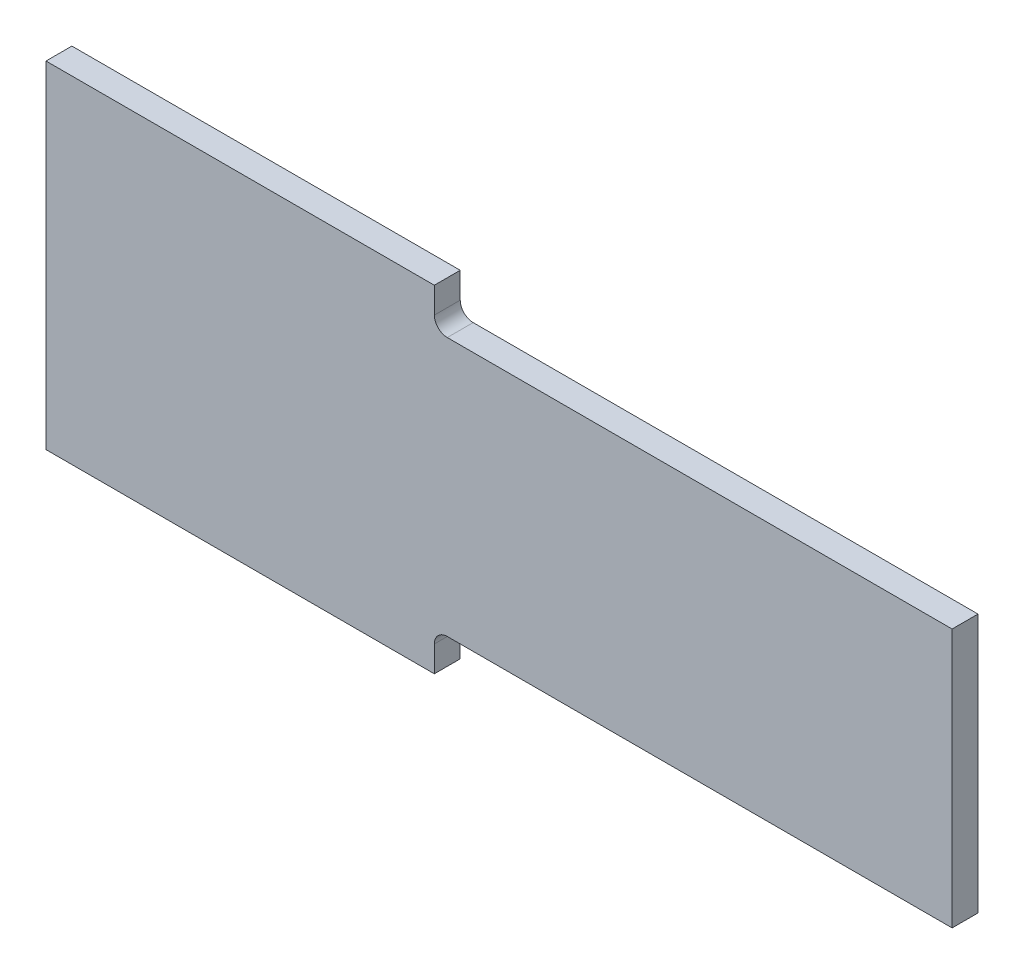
from build123d import *

# Parameters (mm, degrees)
BOSS_EXTRUDE1_DEPTH = 1


with BuildPart() as part:
    # Sketch2 → Boss-Extrude1 (new body)
    with BuildSketch(Plane.XY):
        with BuildLine():
            Line((0, -6.5), (0, 6.5))
            Line((0, 6.5), (15, 6.5))
            Line((15, 6.5), (15, 5.5))
            ThreePointArc((15, 5.5), (15.146446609, 5.146446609), (15.5, 5))
            Line((15.5, 5), (35, 5))
            Line((35, 5), (35, -5))
            Line((35, -5), (15.5, -5))
            ThreePointArc((15.5, -5), (15.146446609, -5.146446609), (15, -5.5))
            Line((15, -5.5), (15, -6.5))
            Line((15, -6.5), (0, -6.5))
        make_face()
    extrude(amount=BOSS_EXTRUDE1_DEPTH)


solid = part.part
